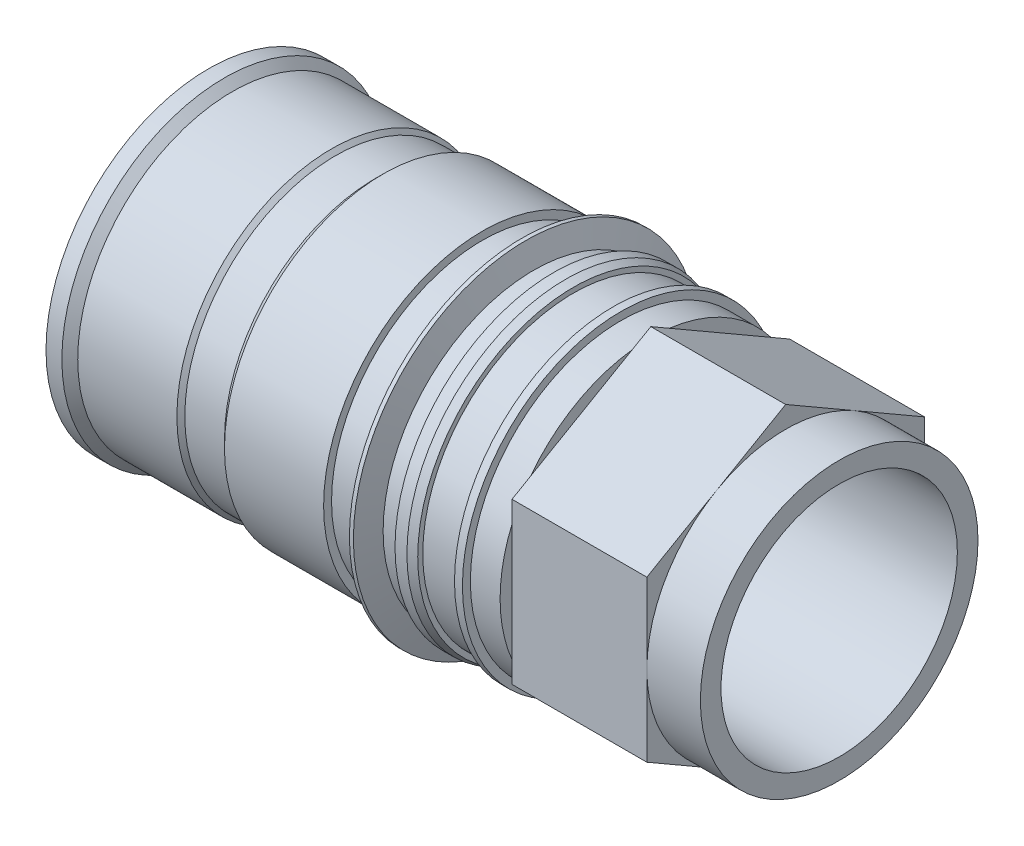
from build123d import *

# Parameters (mm, degrees)
SALIENTE_EXTRUIR1_DEPTH = 34
CROQUIS3_R              = 35
SALIENTE_EXTRUIR2_DEPTH = 13.5
CROQUIS4_R              = 29.8
CORTAR_EXTRUIR1_DEPTH   = 171.483495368


with BuildPart() as part:
    # Croquis1 → Revoluci_n1 (revolve)
    with BuildSketch(Plane.XY, mode=Mode.PRIVATE) as revoluci_n1_sk:
        Polygon((0, 0), (0, 41), (4, 41), (6, 39), (31, 39), (32, 38), (42, 38), (44, 40), (69, 40), (69, 38), (77, 38), (79, 43.494954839), (80, 43.494954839), (82, 38), (87, 38), (87, 40), (90, 40), (92, 39.272059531), (92, 38), (102, 38), (102, 40), (104, 40), (104, 38), (111.5, 38), (111.5, 0), align=None)
    revolve(revoluci_n1_sk.sketch.rotate(Axis((0, 0, 0), (1, 0, 0)), 90), axis=Axis((0, 0, 0), (1, 0, 0)))

    # Croquis2 → Saliente-Extruir1 (add)
    with BuildSketch(Plane(origin=(111.5, 0, 0), x_dir=(0, 0, -1), z_dir=(1, 0, 0))):
        Polygon((0, 40.414518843), (-35, 20.207259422), (-35, -20.207259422), (0, -40.414518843), (35, -20.207259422), (35, 20.207259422), align=None)
    extrude(amount=SALIENTE_EXTRUIR1_DEPTH)

    # Croquis3 → Saliente-Extruir2 (add)
    with BuildSketch(Plane(origin=(145.5, 0, 0), x_dir=(0, 0, -1), z_dir=(1, 0, 0))):
        Circle(CROQUIS3_R)
    extrude(amount=SALIENTE_EXTRUIR2_DEPTH)

    # Croquis4 → Cortar-Extruir1 (cut, through all)
    with BuildSketch(Plane(origin=(159, 0, 0), x_dir=(0, 0, -1), z_dir=(1, 0, 0))):
        Circle(CROQUIS4_R)
    extrude(amount=-CORTAR_EXTRUIR1_DEPTH, mode=Mode.SUBTRACT)


solid = part.part
